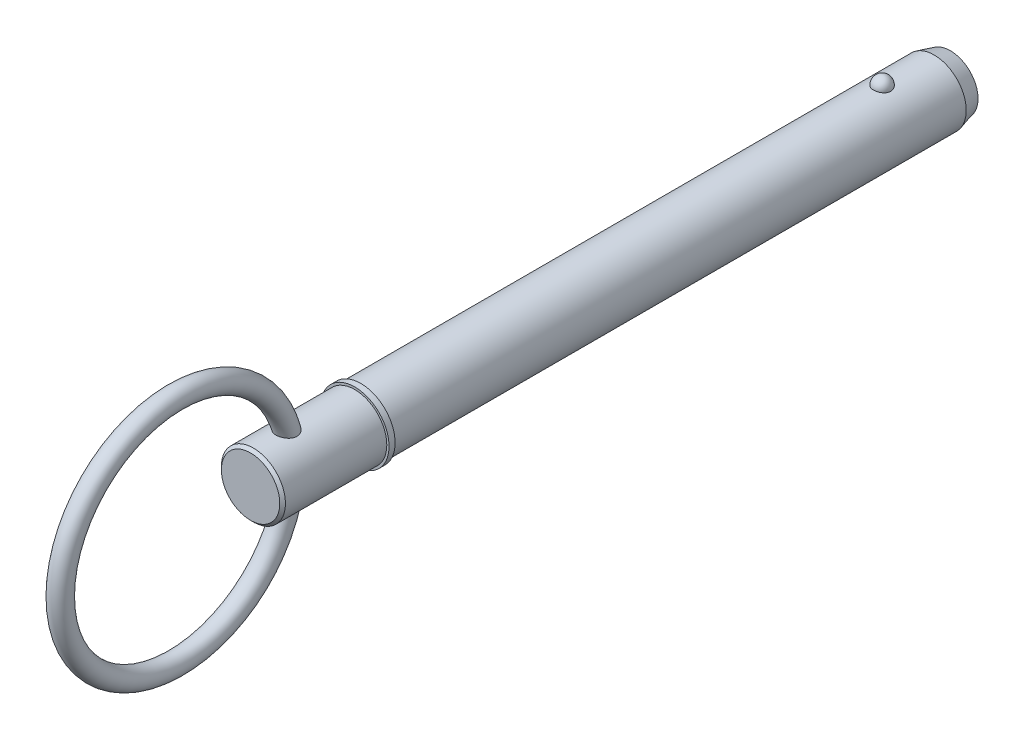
from build123d import *

# Parameters (mm, degrees)
SKETCH2_R           = 7.94
BOSS_EXTRUDE1_DEPTH = 127
BOSS_EXTRUDE2_START = 19.05
SKETCH3_R           = 7.94
BOSS_EXTRUDE2_DEPTH = 19.05
CHAMFER1_SIZE       = 4
CHAMFER1_SIZE2      = 1.07179677
SKETCH20_W          = 1.5
SKETCH20_H          = 8.5
SKETCH21_R          = 7.94
BOSS_EXTRUDE3_DEPTH = 27.31
CHAMFER2_SIZE       = 0.7
SKETCH24_R          = 2.5


with BuildPart() as part:
    # Sketch2 → Boss-Extrude1 (new body)
    with BuildSketch(Plane.XY):
        Circle(SKETCH2_R)
    extrude(amount=BOSS_EXTRUDE1_DEPTH)

    # Sketch3 → Boss-Extrude2 (add)
    with BuildSketch(Plane(origin=(0, 0, 0), x_dir=(-1, 0, 0), z_dir=(0, 0, -1)).offset(BOSS_EXTRUDE2_START)):
        Circle(SKETCH3_R)
    extrude(amount=-BOSS_EXTRUDE2_DEPTH)

    # Chamfer1
    chamfer1_edges = [part.edges().sort_by_distance(p)[0] for p in [
        (7.94, 0, -19.05),
    ]]
    chamfer1_side = [part.faces().sort_by_distance(p)[0] for p in [
        (7.94, 0, -9.525),
    ]]
    chamfer(chamfer1_edges, length=CHAMFER1_SIZE, length2=CHAMFER1_SIZE2, reference=chamfer1_side[0])

    # Sketch18 → Revolve1 (revolve)
    with BuildSketch(Plane(origin=(0, 0, 0), x_dir=(0, 0, -1), z_dir=(1, 0, 0))):
        with BuildLine():
            Line((2.15, 10.09), (2.15, 5.79))
            ThreePointArc((2.15, 5.79), (0, 7.94), (2.15, 10.09))
        make_face()
    revolve(axis=Axis((0, 10.09, -2.15), (0, -1, 0)))

    # Sketch20 → Revolve2 (revolve)
    with BuildSketch(Plane(origin=(0, 0, 0), x_dir=(0, 0, -1), z_dir=(1, 0, 0)), mode=Mode.PRIVATE) as revolve2_sk:
        with Locations((-127.75, 4.25)):
            Rectangle(SKETCH20_W, SKETCH20_H)
    revolve(revolve2_sk.sketch.rotate(Axis((0, 0, 33.728787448), (0, 0, 1)), 90), axis=Axis((0, 0, 33.728787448), (0, 0, 1)))

    # Sketch21 → Boss-Extrude3 (add)
    with BuildSketch(Plane(origin=(0, 0, 127), x_dir=(-1, 0, 0), z_dir=(0, 0, -1))):
        Circle(SKETCH21_R)
    extrude(amount=-BOSS_EXTRUDE3_DEPTH)

    # Chamfer2
    chamfer2_edges = [part.edges().sort_by_distance(p)[0] for p in [
        (7.94, 0, 154.31),
    ]]
    chamfer(chamfer2_edges, length=CHAMFER2_SIZE)

    # Sweep1: sweep along a path in Sketch23
    with BuildLine(Plane(origin=(0, 0, 0), x_dir=(0, 0, -1), z_dir=(1, 0, 0))) as sweep1_path:
        CenterArc((-172.885, 0), 28.575, 0, 360)
    # Sketch24 → Sweep1 (sweep)
    with BuildSketch(Plane(origin=(0, 0, 0), x_dir=(1, 0, 0), z_dir=(0, 1, 0))):
        with Locations((0, -144.31)):
            Circle(SKETCH24_R)
    sweep(path=sweep1_path.line)


solid = part.part
